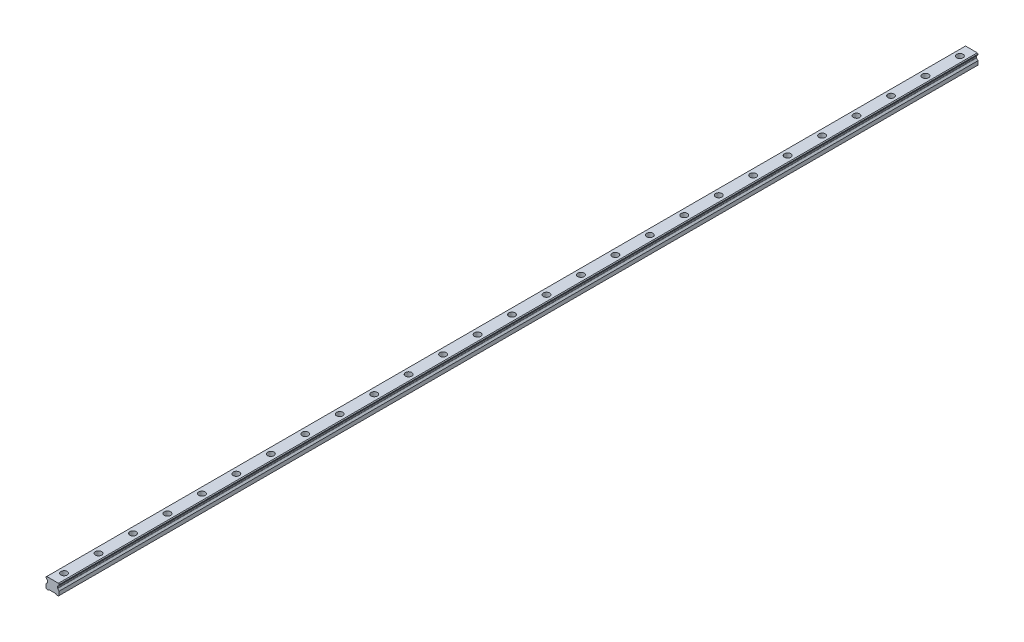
from build123d import *

# Parameters (mm, degrees)
SKETCH1_W           = 23
SKETCH1_H           = 19.2
BOSS_EXTRUDE1_DEPTH = 800
CUT_EXTRUDE1_DEPTH  = 1601.156520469
CHAMFER1_SIZE       = 1.25
FILLET1_R           = 1.25
CUT_EXTRUDE2_DEPTH  = 1601.156520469
SKETCH4_R           = 5.5
SKETCH4_R_2         = 3.5
CUT_EXTRUDE3_DEPTH  = 9
SKETCH4_2_R         = 3.5
CUT_EXTRUDE4_DEPTH  = 801.312995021
LPATTERN1_COUNT     = 27
LPATTERN1_PITCH     = 60


with BuildPart() as part:
    # Sketch1 → Boss-Extrude1 (new, symmetric)
    with BuildSketch(Plane.XY):
        with Locations((0, 9.6)):
            Rectangle(SKETCH1_W, SKETCH1_H)
    extrude(amount=BOSS_EXTRUDE1_DEPTH, both=True)

    # Sketch2 → Cut-Extrude1 (cut, through all)
    with BuildSketch(Plane.XY.offset(800)):
        Polygon((-11.5, 16.7), (-11.5, 7.95), (-8.583333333, 10.866666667), (-8.583333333, 13.783333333), align=None)
        Polygon((8.583333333, 13.783333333), (11.5, 16.7), (11.5, 7.95), (8.583333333, 10.866666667), align=None)
    extrude(amount=-CUT_EXTRUDE1_DEPTH, mode=Mode.SUBTRACT)

    # Chamfer1
    chamfer1_edges = [part.edges().sort_by_distance(p)[0] for p in [
        (-11.5, 19.2, 0),
        (11.5, 19.2, 0),
        (11.5, 0, 0),
        (-11.5, 0, 0),
    ]]
    chamfer(chamfer1_edges, length=CHAMFER1_SIZE)

    # Fillet1
    fillet1_edges = [part.edges().sort_by_distance(p)[0] for p in [
        (-8.583333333, 13.783333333, 0),
        (-8.583333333, 10.866666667, 0),
        (8.583333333, 10.866666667, 0),
        (8.583333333, 13.783333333, 0),
    ]]
    fillet(fillet1_edges, radius=FILLET1_R)

    # Sketch3 → Cut-Extrude2 (cut, through all)
    with BuildSketch(Plane.XY.offset(800)):
        Polygon((-7, 0), (-5.75, 1.25), (5.75, 1.25), (7, 0), align=None)
    extrude(amount=-CUT_EXTRUDE2_DEPTH, mode=Mode.SUBTRACT)

    # Sketch4 → Cut-Extrude3 (cut)
    with BuildSketch(Plane(origin=(0, 19.2, 0), x_dir=(1, 0, 0), z_dir=(0, 1, 0))):
        with Locations(Location((0, -780, 0), (0, 0, 270))):
            Circle(SKETCH4_R)
        with Locations(Location((0, -780, 0), (0, 0, 270))):
            Circle(SKETCH4_R_2, mode=Mode.SUBTRACT)
    cut_extrude3 = extrude(amount=-CUT_EXTRUDE3_DEPTH, mode=Mode.SUBTRACT)

    # Sketch4_2 → Cut-Extrude4 (cut, through all)
    with BuildSketch(Plane(origin=(0, 19.2, 0), x_dir=(1, 0, 0), z_dir=(0, 1, 0))):
        with Locations(Location((0, -780, 0), (0, 0, 270))):
            Circle(SKETCH4_2_R)
    cut_extrude4 = extrude(amount=-CUT_EXTRUDE4_DEPTH, mode=Mode.SUBTRACT)

    # LPattern1: Cut-Extrude3, Cut-Extrude4 ×27
    with Locations(*[(0, 0, -i * LPATTERN1_PITCH) for i in range(1, LPATTERN1_COUNT)]):
        add(cut_extrude3, mode=Mode.SUBTRACT)
        add(cut_extrude4, mode=Mode.SUBTRACT)


solid = part.part
